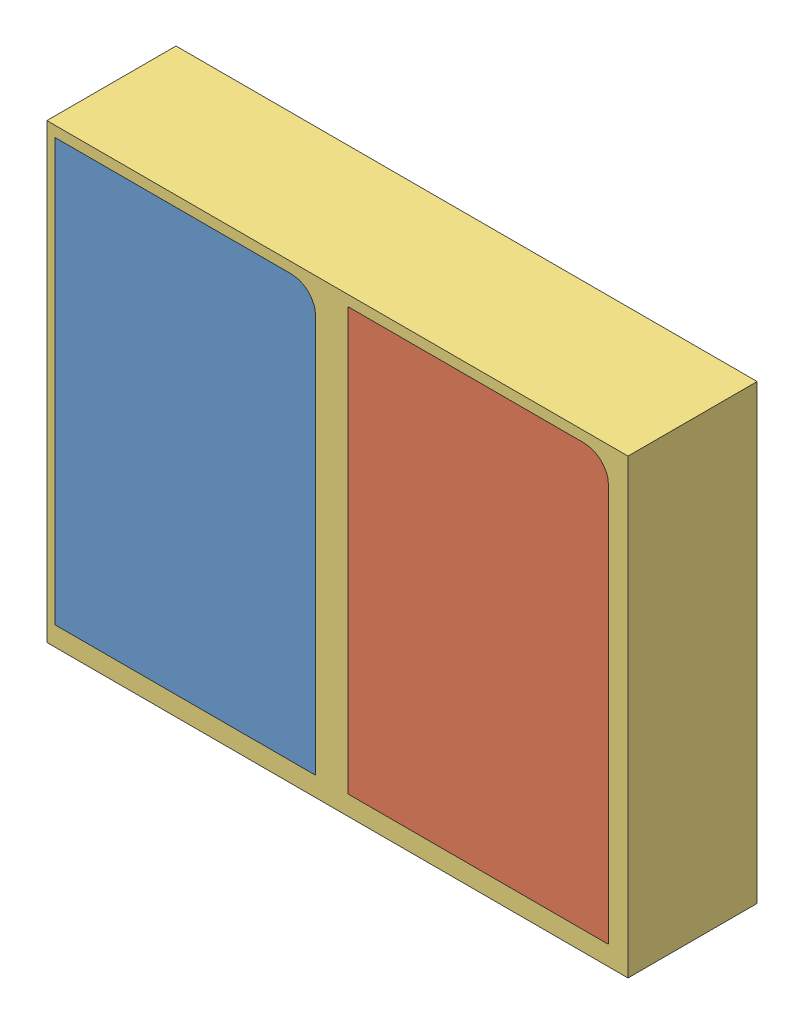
SolidWorks assembly smalltocnc.SLDASM, configuration Default (file format 13000). Lengths in mm.
Overall size (90 70 20).
3 component instances, 3 part files, 6 mates.
Components (placement in the parent):
- small_Mold_b^negative_mold-1: small_Mold_b^negative_mold.SLDPRT [Default] at (19.4739 4.5256 0.2735) size (40.36 65.36 10) (hidden)
- small_mold_a-1: small_mold_a.SLDPRT [Default] at (64.8329 4.5256 0.2735) size (40.36 65.36 11.5) (hidden)
- Positive-1: Positive.SLDPRT [Default] at (16.797 9.6513 10.2735) size (90 70 30)
Mates (geometry in assembly coordinates):
- Coincident1: coincident aligned: plane of small_Mold_b^negative_mold-1 through (19.4739 4.5256 0.2735) normal (0 0 -1); plane of small_mold_a-1 through (64.8329 4.5256 0.2735) normal (0 0 -1)
- Coincident8: coincident aligned: plane of small_Mold_b^negative_mold-1 through (36.9739 59.5256 0.2735) normal (0 0.965926 -0.258819); plane of small_mold_a-1 through (82.3329 59.5256 0.2735) normal (0 0.965926 -0.258819)
- Distance4: distance = 5 mm: line of small_mold_a-1 through (44.6534 62.2051 10.2735) axis (0 -1 0); line of small_Mold_b^negative_mold-1 through (39.6534 -3.1539 10.2735) axis (0 1 0)
- Distance7: distance = 3 mm: line of small_mold_a-1 through (44.6534 -3.1539 10.2735) axis (1 0 0); line of Positive-1 through (-1.9876 -6.1539 10.2735) axis (1 0 0)
- Coincident10: coincident aligned: plane of small_mold_a-1 through (64.8329 4.5256 10.2735) normal (0 0 1); plane of Positive-1 through (16.797 9.6513 10.2735) normal (0 0 1)
- Distance8: distance = 3 mm: line of small_mold_a-1 through (85.0124 -3.1539 10.2735) axis (0 1 0); line of Positive-1 through (88.0124 -6.1539 10.2735) axis (0 1 0)
